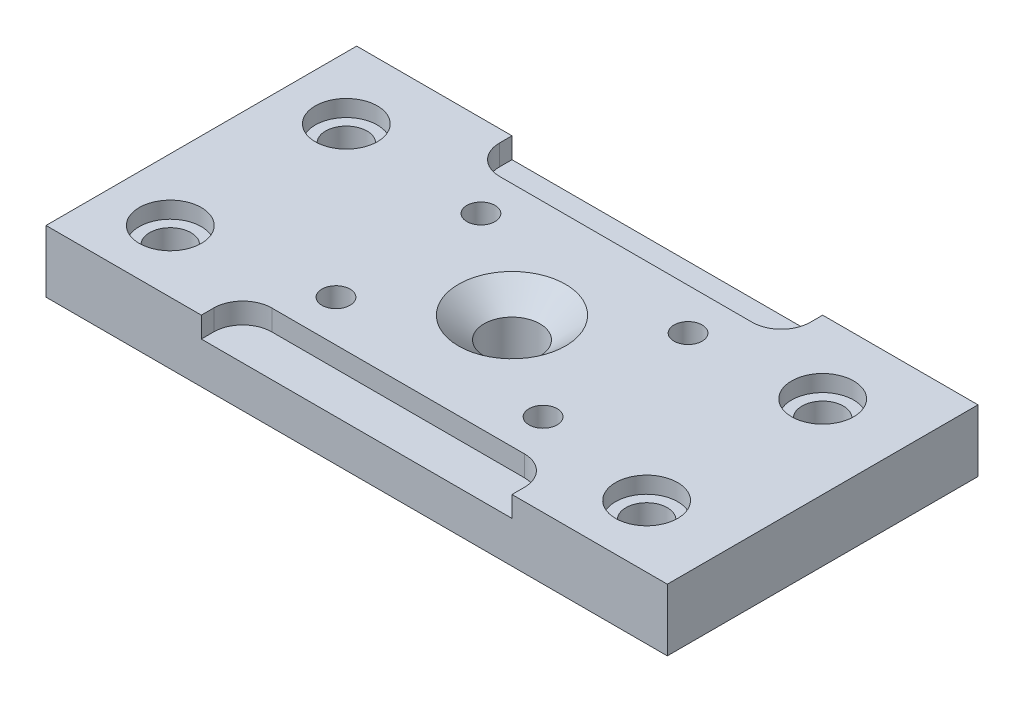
from build123d import *

# Parameters (mm, degrees)
SKETCH2_W                                           = 150
SKETCH2_H                                           = 75
EXTRUDE1_DEPTH                                      = 15
CUT_EXTRUDE2_DEPTH                                  = 5
CSK_FOR_1_2_FLAT_HEAD_MACHINE_SCREW_100_D           = 13.49248
CSK_FOR_1_2_FLAT_HEAD_MACHINE_SCREW_100_DEPTH       = 25
CSK_FOR_1_2_FLAT_HEAD_MACHINE_SCREW_100_CSINK_D     = 25.8318
CSK_FOR_1_2_FLAT_HEAD_MACHINE_SCREW_100_CSINK_ANGLE = 100
CSK_FOR_1_2_FLAT_HEAD_MACHINE_SCREW_100_TIP         = 4.053549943
LPATTERN1_COUNT                                     = 2
LPATTERN1_PITCH                                     = 42.5
LPATTERN1_COUNT_DIR2                                = 2
LPATTERN1_PITCH_DIR2                                = 115
M8X1_25_TAPPED_HOLE1_D                              = 6.8


with BuildPart() as part:
    # Sketch2 → Extrude1 (new body)
    with BuildSketch(Plane(origin=(0, 0, 0), x_dir=(1, 0, 0), z_dir=(0, 1, 0))):
        Rectangle(SKETCH2_W, SKETCH2_H)
    extrude(amount=EXTRUDE1_DEPTH)

    # Sketch3 → Cut-Extrude2 (cut)
    with BuildSketch(Plane(origin=(0, 15, 0), x_dir=(-1, 0, 0), z_dir=(0, 1, 0))):
        with BuildLine():
            Line((-37.5, 37.5), (-37.5, 34.5))
            ThreePointArc((-37.5, 34.5), (-35.449747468, 29.550252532), (-30.5, 27.5))
            Line((-30.5, 27.5), (30.5, 27.5))
            ThreePointArc((30.5, 27.5), (35.449747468, 29.550252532), (37.5, 34.5))
            Line((37.5, 34.5), (37.5, 37.5))
            Line((37.5, 37.5), (-37.5, 37.5))
        make_face()
        with BuildLine():
            Line((37.5, -37.5), (37.5, -34.5))
            ThreePointArc((37.5, -34.5), (35.449747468, -29.550252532), (30.5, -27.5))
            Line((30.5, -27.5), (-30.5, -27.5))
            ThreePointArc((-30.5, -27.5), (-35.449747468, -29.550252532), (-37.5, -34.5))
            Line((-37.5, -34.5), (-37.5, -37.5))
            Line((-37.5, -37.5), (37.5, -37.5))
        make_face()
    extrude(amount=-CUT_EXTRUDE2_DEPTH, mode=Mode.SUBTRACT)

    # CSK for 1_2 Flat Head Machine Screw _100
    with Locations(Plane(origin=(0, 15, 0), x_dir=(-1, 0, 0), z_dir=(0, 1, 0))):
        with Locations((0, 0)):
            CounterSinkHole(CSK_FOR_1_2_FLAT_HEAD_MACHINE_SCREW_100_D / 2, CSK_FOR_1_2_FLAT_HEAD_MACHINE_SCREW_100_CSINK_D / 2, depth=CSK_FOR_1_2_FLAT_HEAD_MACHINE_SCREW_100_DEPTH, counter_sink_angle=CSK_FOR_1_2_FLAT_HEAD_MACHINE_SCREW_100_CSINK_ANGLE)
            with Locations((0, 0, -(CSK_FOR_1_2_FLAT_HEAD_MACHINE_SCREW_100_DEPTH + CSK_FOR_1_2_FLAT_HEAD_MACHINE_SCREW_100_TIP / 2))):  # 118° drill point
                Cone(0, CSK_FOR_1_2_FLAT_HEAD_MACHINE_SCREW_100_D / 2, CSK_FOR_1_2_FLAT_HEAD_MACHINE_SCREW_100_TIP, mode=Mode.SUBTRACT)

    # Sketch6 → CBORE for M8 SHCS1 (revolve, cut)
    with BuildSketch(Plane(origin=(-60, 15, 22.5), x_dir=(0, 0, 1), z_dir=(1, 0, 0))):
        Polygon((0, 0), (0, 43.004303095), (5, 40), (5, 4), (7.5, 4), (7.5, 0), align=None)
    cbore_for_m8_shcs1 = revolve(axis=Axis((-60, 21.35, 22.5), (0, -1, 0)), mode=Mode.SUBTRACT)

    # LPattern1: CBORE for M8 SHCS1 2 × 2
    with Locations(*[(j * LPATTERN1_PITCH_DIR2, 0, -i * LPATTERN1_PITCH) for i in range(LPATTERN1_COUNT) for j in range(LPATTERN1_COUNT_DIR2) if (i, j) != (0, 0)]):
        add(cbore_for_m8_shcs1, mode=Mode.SUBTRACT)

    # M8x1.25 Tapped Hole1 (through all)
    with Locations(Plane(origin=(0, 15, 0), x_dir=(-1, 0, 0), z_dir=(0, 1, 0))):
        with Locations((-25, 17.5), (25, 17.5), (25, -17.5), (-25, -17.5)):
            Hole(M8X1_25_TAPPED_HOLE1_D / 2)


solid = part.part
